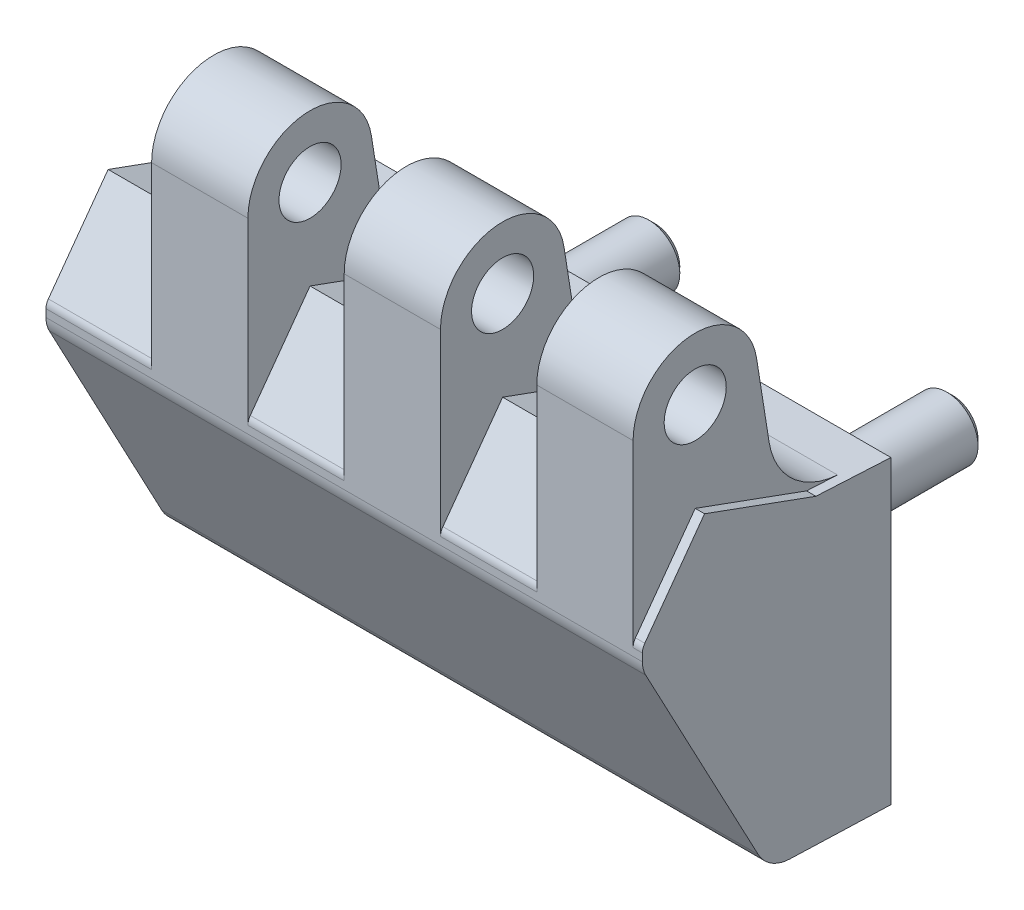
ISO-10303-21;
HEADER;
FILE_DESCRIPTION(('STEP AP214'),'2;1');
FILE_NAME('part.step','',(''),(''),'','','');
FILE_SCHEMA(('AUTOMOTIVE_DESIGN { 1 0 10303 214 1 1 1 1 }'));
ENDSEC;
DATA;
#1=APPLICATION_CONTEXT('core data for automotive mechanical design processes');
#2=APPLICATION_PROTOCOL_DEFINITION('international standard','automotive_design',2000,#1);
#3=PRODUCT_CONTEXT('',#1,'mechanical');
#4=PRODUCT('Part','Part','',(#3));
#5=PRODUCT_RELATED_PRODUCT_CATEGORY('part','',(#4));
#6=PRODUCT_DEFINITION_FORMATION('','',#4);
#7=PRODUCT_DEFINITION_CONTEXT('part definition',#1,'design');
#8=PRODUCT_DEFINITION('design','',#6,#7);
#9=PRODUCT_DEFINITION_SHAPE('','',#8);
#10=(LENGTH_UNIT() NAMED_UNIT(*) SI_UNIT(.MILLI.,.METRE.));
#11=(NAMED_UNIT(*) PLANE_ANGLE_UNIT() SI_UNIT($,.RADIAN.));
#12=(NAMED_UNIT(*) SI_UNIT($,.STERADIAN.) SOLID_ANGLE_UNIT());
#13=UNCERTAINTY_MEASURE_WITH_UNIT(LENGTH_MEASURE(1.E-05),#10,'distance_accuracy_value','');
#14=(GEOMETRIC_REPRESENTATION_CONTEXT(3) GLOBAL_UNCERTAINTY_ASSIGNED_CONTEXT((#13)) GLOBAL_UNIT_ASSIGNED_CONTEXT((#10,
#11,#12)) REPRESENTATION_CONTEXT('',''));
#15=CARTESIAN_POINT('',(0.,0.,0.));
#16=DIRECTION('',(0.,0.,1.));
#17=DIRECTION('',(1.,0.,0.));
#18=AXIS2_PLACEMENT_3D('',#15,#16,#17);
#19=CARTESIAN_POINT('',(-12.25,12.2,0.));
#20=DIRECTION('',(0.,0.99862953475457,-0.0523359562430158));
#21=DIRECTION('',(0.,0.0523359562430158,0.99862953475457));
#22=AXIS2_PLACEMENT_3D('',#19,#20,#21);
#23=PLANE('',#22);
#24=DIRECTION('',(1.,0.,0.));
#25=VECTOR('',#24,1.);
#26=CARTESIAN_POINT('',(-12.25,12.2,0.));
#27=LINE('',#26,#25);
#28=CARTESIAN_POINT('',(-12.,12.2,0.));
#29=VERTEX_POINT('',#28);
#30=CARTESIAN_POINT('',(36.,12.2,0.));
#31=VERTEX_POINT('',#30);
#32=EDGE_CURVE('E259',#29,#31,#27,.T.);
#33=ORIENTED_EDGE('',*,*,#32,.F.);
#34=DIRECTION('',(0.,-0.0523359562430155,-0.99862953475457));
#35=VECTOR('',#34,1.);
#36=CARTESIAN_POINT('',(-12.,12.516495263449,6.0390893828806));
#37=LINE('',#36,#35);
#38=CARTESIAN_POINT('',(-12.,12.516495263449,6.0390893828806));
#39=VERTEX_POINT('',#38);
#40=EDGE_CURVE('E241',#39,#29,#37,.T.);
#41=ORIENTED_EDGE('',*,*,#40,.F.);
#42=DIRECTION('',(1.,0.,0.));
#43=VECTOR('',#42,1.);
#44=CARTESIAN_POINT('',(-12.25,12.516495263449,6.0390893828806));
#45=LINE('',#44,#43);
#46=CARTESIAN_POINT('',(-3.5,12.516495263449,6.0390893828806));
#47=VERTEX_POINT('',#46);
#48=EDGE_CURVE('E263',#39,#47,#45,.T.);
#49=ORIENTED_EDGE('',*,*,#48,.T.);
#50=DIRECTION('',(0.,0.0523359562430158,0.99862953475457));
#51=VECTOR('',#50,1.);
#52=CARTESIAN_POINT('',(-3.5,12.2,0.));
#53=LINE('',#52,#51);
#54=CARTESIAN_POINT('',(-3.5,12.386207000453,3.55304122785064));
#55=VERTEX_POINT('',#54);
#56=EDGE_CURVE('E1156',#55,#47,#53,.T.);
#57=ORIENTED_EDGE('',*,*,#56,.F.);
#58=DIRECTION('',(1.,0.,0.));
#59=VECTOR('',#58,1.);
#60=CARTESIAN_POINT('',(-3.5,12.386207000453,3.55304122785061));
#61=LINE('',#60,#59);
#62=CARTESIAN_POINT('',(4.25,12.386207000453,3.55304122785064));
#63=VERTEX_POINT('',#62);
#64=EDGE_CURVE('E261',#63,#55,#61,.F.);
#65=ORIENTED_EDGE('',*,*,#64,.F.);
#66=DIRECTION('',(0.,0.0523359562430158,0.99862953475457));
#67=VECTOR('',#66,1.);
#68=CARTESIAN_POINT('',(4.25,12.2,0.));
#69=LINE('',#68,#67);
#70=CARTESIAN_POINT('',(4.25,12.516495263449,6.0390893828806));
#71=VERTEX_POINT('',#70);
#72=EDGE_CURVE('E1284',#63,#71,#69,.T.);
#73=ORIENTED_EDGE('',*,*,#72,.T.);
#74=CARTESIAN_POINT('',(12.,12.516495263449,6.0390893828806));
#75=VERTEX_POINT('',#74);
#76=EDGE_CURVE('E1225',#71,#75,#45,.T.);
#77=ORIENTED_EDGE('',*,*,#76,.T.);
#78=DIRECTION('',(0.,0.0523359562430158,0.99862953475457));
#79=VECTOR('',#78,1.);
#80=CARTESIAN_POINT('',(12.,12.2,0.));
#81=LINE('',#80,#79);
#82=CARTESIAN_POINT('',(12.,12.386207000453,3.55304122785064));
#83=VERTEX_POINT('',#82);
#84=EDGE_CURVE('E1193',#83,#75,#81,.T.);
#85=ORIENTED_EDGE('',*,*,#84,.F.);
#86=DIRECTION('',(-1.,0.,0.));
#87=VECTOR('',#86,1.);
#88=CARTESIAN_POINT('',(19.75,12.386207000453,3.55304122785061));
#89=LINE('',#88,#87);
#90=CARTESIAN_POINT('',(19.75,12.386207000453,3.55304122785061));
#91=VERTEX_POINT('',#90);
#92=EDGE_CURVE('E258',#83,#91,#89,.F.);
#93=ORIENTED_EDGE('',*,*,#92,.T.);
#94=DIRECTION('',(0.,0.0523359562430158,0.99862953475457));
#95=VECTOR('',#94,1.);
#96=CARTESIAN_POINT('',(19.75,12.2,0.));
#97=LINE('',#96,#95);
#98=CARTESIAN_POINT('',(19.75,12.516495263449,6.0390893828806));
#99=VERTEX_POINT('',#98);
#100=EDGE_CURVE('E1202',#91,#99,#97,.T.);
#101=ORIENTED_EDGE('',*,*,#100,.T.);
#102=CARTESIAN_POINT('',(27.5,12.516495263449,6.0390893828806));
#103=VERTEX_POINT('',#102);
#104=EDGE_CURVE('E1226',#99,#103,#45,.T.);
#105=ORIENTED_EDGE('',*,*,#104,.T.);
#106=DIRECTION('',(0.,0.0523359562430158,0.99862953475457));
#107=VECTOR('',#106,1.);
#108=CARTESIAN_POINT('',(27.5,12.2,0.));
#109=LINE('',#108,#107);
#110=CARTESIAN_POINT('',(27.5,12.386207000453,3.55304122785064));
#111=VERTEX_POINT('',#110);
#112=EDGE_CURVE('E1233',#111,#103,#109,.T.);
#113=ORIENTED_EDGE('',*,*,#112,.F.);
#114=DIRECTION('',(-1.,0.,0.));
#115=VECTOR('',#114,1.);
#116=CARTESIAN_POINT('',(35.25,12.386207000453,3.55304122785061));
#117=LINE('',#116,#115);
#118=CARTESIAN_POINT('',(35.25,12.386207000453,3.55304122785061));
#119=VERTEX_POINT('',#118);
#120=EDGE_CURVE('E268',#111,#119,#117,.F.);
#121=ORIENTED_EDGE('',*,*,#120,.T.);
#122=DIRECTION('',(0.,0.0523359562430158,0.99862953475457));
#123=VECTOR('',#122,1.);
#124=CARTESIAN_POINT('',(35.25,12.2,0.));
#125=LINE('',#124,#123);
#126=CARTESIAN_POINT('',(35.25,12.516495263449,6.0390893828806));
#127=VERTEX_POINT('',#126);
#128=EDGE_CURVE('E1114',#119,#127,#125,.T.);
#129=ORIENTED_EDGE('',*,*,#128,.T.);
#130=CARTESIAN_POINT('',(36.,12.516495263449,6.0390893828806));
#131=VERTEX_POINT('',#130);
#132=EDGE_CURVE('E1222',#127,#131,#45,.T.);
#133=ORIENTED_EDGE('',*,*,#132,.T.);
#134=DIRECTION('',(0.,0.0523359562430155,0.99862953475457));
#135=VECTOR('',#134,1.);
#136=CARTESIAN_POINT('',(36.,12.2,0.));
#137=LINE('',#136,#135);
#138=EDGE_CURVE('E1403',#31,#131,#137,.T.);
#139=ORIENTED_EDGE('',*,*,#138,.F.);
#140=EDGE_LOOP('',(#33,#41,#49,#57,#65,#73,#77,#85,#93,#101,#105,#113,#121,#129,#133,#139));
#141=FACE_BOUND('',#140,.T.);
#142=ADVANCED_FACE('F14',(#141),#23,.T.);
#143=CARTESIAN_POINT('',(-12.25,-11.715773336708,8.1391867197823));
#144=DIRECTION('',(0.,-0.999390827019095,0.0348994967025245));
#145=DIRECTION('',(0.,-0.0348994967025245,-0.999390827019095));
#146=AXIS2_PLACEMENT_3D('',#143,#144,#145);
#147=PLANE('',#146);
#148=DIRECTION('',(1.,0.,0.));
#149=VECTOR('',#148,1.);
#150=CARTESIAN_POINT('',(-12.25,-11.715773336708,8.1391867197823));
#151=LINE('',#150,#149);
#152=CARTESIAN_POINT('',(-12.,-11.715773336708,8.1391867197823));
#153=VERTEX_POINT('',#152);
#154=CARTESIAN_POINT('',(36.,-11.715773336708,8.1391867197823));
#155=VERTEX_POINT('',#154);
#156=EDGE_CURVE('E251',#153,#155,#151,.T.);
#157=ORIENTED_EDGE('',*,*,#156,.F.);
#158=DIRECTION('',(0.,0.034899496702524,0.999390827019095));
#159=VECTOR('',#158,1.);
#160=CARTESIAN_POINT('',(-12.,-12.,0.));
#161=LINE('',#160,#159);
#162=CARTESIAN_POINT('',(-12.,-12.,0.));
#163=VERTEX_POINT('',#162);
#164=EDGE_CURVE('E238',#163,#153,#161,.T.);
#165=ORIENTED_EDGE('',*,*,#164,.F.);
#166=DIRECTION('',(1.,0.,0.));
#167=VECTOR('',#166,1.);
#168=CARTESIAN_POINT('',(-12.25,-12.,0.));
#169=LINE('',#168,#167);
#170=CARTESIAN_POINT('',(36.,-12.,0.));
#171=VERTEX_POINT('',#170);
#172=EDGE_CURVE('E249',#163,#171,#169,.T.);
#173=ORIENTED_EDGE('',*,*,#172,.T.);
#174=DIRECTION('',(0.,-0.034899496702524,-0.999390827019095));
#175=VECTOR('',#174,1.);
#176=CARTESIAN_POINT('',(36.,-11.715773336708,8.1391867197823));
#177=LINE('',#176,#175);
#178=EDGE_CURVE('E1406',#155,#171,#177,.T.);
#179=ORIENTED_EDGE('',*,*,#178,.F.);
#180=EDGE_LOOP('',(#157,#165,#173,#179));
#181=FACE_BOUND('',#180,.T.);
#182=ADVANCED_FACE('F16',(#181),#147,.T.);
#183=CARTESIAN_POINT('',(-12.25,-12.,0.));
#184=DIRECTION('',(0.,0.,-1.));
#185=DIRECTION('',(-1.,0.,0.));
#186=AXIS2_PLACEMENT_3D('',#183,#184,#185);
#187=PLANE('',#186);
#188=CARTESIAN_POINT('',(0.,0.,0.));
#189=DIRECTION('',(0.,0.,-1.));
#190=DIRECTION('',(-1.,0.,0.));
#191=AXIS2_PLACEMENT_3D('',#188,#189,#190);
#192=CIRCLE('',#191,2.5);
#193=CARTESIAN_POINT('',(-2.5,0.,0.));
#194=VERTEX_POINT('',#193);
#195=EDGE_CURVE('E9',#194,#194,#192,.T.);
#196=ORIENTED_EDGE('',*,*,#195,.F.);
#197=EDGE_LOOP('',(#196));
#198=FACE_BOUND('',#197,.T.);
#199=CARTESIAN_POINT('',(24.,0.,0.));
#200=DIRECTION('',(0.,0.,-1.));
#201=DIRECTION('',(-1.,0.,0.));
#202=AXIS2_PLACEMENT_3D('',#199,#200,#201);
#203=CIRCLE('',#202,2.5);
#204=CARTESIAN_POINT('',(21.5,0.,0.));
#205=VERTEX_POINT('',#204);
#206=EDGE_CURVE('E22',#205,#205,#203,.T.);
#207=ORIENTED_EDGE('',*,*,#206,.F.);
#208=EDGE_LOOP('',(#207));
#209=FACE_BOUND('',#208,.T.);
#210=ORIENTED_EDGE('',*,*,#172,.F.);
#211=DIRECTION('',(0.,-1.,0.));
#212=VECTOR('',#211,1.);
#213=CARTESIAN_POINT('',(-12.,12.2,0.));
#214=LINE('',#213,#212);
#215=EDGE_CURVE('E235',#29,#163,#214,.T.);
#216=ORIENTED_EDGE('',*,*,#215,.F.);
#217=ORIENTED_EDGE('',*,*,#32,.T.);
#218=DIRECTION('',(0.,1.,0.));
#219=VECTOR('',#218,1.);
#220=CARTESIAN_POINT('',(36.,-12.,0.));
#221=LINE('',#220,#219);
#222=EDGE_CURVE('E257',#171,#31,#221,.T.);
#223=ORIENTED_EDGE('',*,*,#222,.F.);
#224=EDGE_LOOP('',(#210,#216,#217,#223));
#225=FACE_BOUND('',#224,.T.);
#226=ADVANCED_FACE('F255',(#198,#209,#225),#187,.T.);
#227=CARTESIAN_POINT('',(-12.25,8.571170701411,20.));
#228=DIRECTION('',(0.,0.,1.));
#229=DIRECTION('',(1.,0.,0.));
#230=AXIS2_PLACEMENT_3D('',#227,#228,#229);
#231=PLANE('',#230);
#232=DIRECTION('',(1.,0.,0.));
#233=VECTOR('',#232,1.);
#234=CARTESIAN_POINT('',(-12.25,8.571170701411,20.));
#235=LINE('',#234,#233);
#236=CARTESIAN_POINT('',(-12.,8.571170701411,20.));
#237=VERTEX_POINT('',#236);
#238=CARTESIAN_POINT('',(-3.5,8.571170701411,20.));
#239=VERTEX_POINT('',#238);
#240=EDGE_CURVE('E1211',#237,#239,#235,.T.);
#241=ORIENTED_EDGE('',*,*,#240,.F.);
#242=DIRECTION('',(0.,1.,0.));
#243=VECTOR('',#242,1.);
#244=CARTESIAN_POINT('',(-12.,7.95707840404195,20.));
#245=LINE('',#244,#243);
#246=CARTESIAN_POINT('',(-12.,7.95707840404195,20.));
#247=VERTEX_POINT('',#246);
#248=EDGE_CURVE('E29',#247,#237,#245,.T.);
#249=ORIENTED_EDGE('',*,*,#248,.F.);
#250=DIRECTION('',(1.,0.,0.));
#251=VECTOR('',#250,1.);
#252=CARTESIAN_POINT('',(-12.25,7.957078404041,20.));
#253=LINE('',#252,#251);
#254=CARTESIAN_POINT('',(36.,7.957078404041,20.));
#255=VERTEX_POINT('',#254);
#256=EDGE_CURVE('E1208',#247,#255,#253,.T.);
#257=ORIENTED_EDGE('',*,*,#256,.T.);
#258=DIRECTION('',(0.,-1.,0.));
#259=VECTOR('',#258,1.);
#260=CARTESIAN_POINT('',(36.,8.571170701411,20.));
#261=LINE('',#260,#259);
#262=CARTESIAN_POINT('',(36.,8.571170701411,20.));
#263=VERTEX_POINT('',#262);
#264=EDGE_CURVE('E1355',#263,#255,#261,.T.);
#265=ORIENTED_EDGE('',*,*,#264,.F.);
#266=CARTESIAN_POINT('',(35.25,8.571170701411,20.));
#267=VERTEX_POINT('',#266);
#268=EDGE_CURVE('E1210',#267,#263,#235,.T.);
#269=ORIENTED_EDGE('',*,*,#268,.F.);
#270=DIRECTION('',(0.,-1.,0.));
#271=VECTOR('',#270,1.);
#272=CARTESIAN_POINT('',(35.25,23.,20.));
#273=LINE('',#272,#271);
#274=CARTESIAN_POINT('',(35.25,23.,20.));
#275=VERTEX_POINT('',#274);
#276=EDGE_CURVE('E1090',#275,#267,#273,.T.);
#277=ORIENTED_EDGE('',*,*,#276,.F.);
#278=DIRECTION('',(-1.,0.,0.));
#279=VECTOR('',#278,1.);
#280=CARTESIAN_POINT('',(35.25,23.,20.));
#281=LINE('',#280,#279);
#282=CARTESIAN_POINT('',(27.5,23.,20.));
#283=VERTEX_POINT('',#282);
#284=EDGE_CURVE('E1370',#275,#283,#281,.T.);
#285=ORIENTED_EDGE('',*,*,#284,.T.);
#286=DIRECTION('',(0.,-1.,0.));
#287=VECTOR('',#286,1.);
#288=CARTESIAN_POINT('',(27.5,23.,20.));
#289=LINE('',#288,#287);
#290=CARTESIAN_POINT('',(27.5,8.571170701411,20.));
#291=VERTEX_POINT('',#290);
#292=EDGE_CURVE('E1103',#283,#291,#289,.T.);
#293=ORIENTED_EDGE('',*,*,#292,.T.);
#294=CARTESIAN_POINT('',(19.75,8.571170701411,20.));
#295=VERTEX_POINT('',#294);
#296=EDGE_CURVE('E1215',#295,#291,#235,.T.);
#297=ORIENTED_EDGE('',*,*,#296,.F.);
#298=DIRECTION('',(0.,-1.,0.));
#299=VECTOR('',#298,1.);
#300=CARTESIAN_POINT('',(19.75,23.,20.));
#301=LINE('',#300,#299);
#302=CARTESIAN_POINT('',(19.75,23.,20.));
#303=VERTEX_POINT('',#302);
#304=EDGE_CURVE('E1139',#303,#295,#301,.T.);
#305=ORIENTED_EDGE('',*,*,#304,.F.);
#306=DIRECTION('',(-1.,0.,0.));
#307=VECTOR('',#306,1.);
#308=CARTESIAN_POINT('',(19.75,23.,20.));
#309=LINE('',#308,#307);
#310=CARTESIAN_POINT('',(12.,23.,20.));
#311=VERTEX_POINT('',#310);
#312=EDGE_CURVE('E1176',#303,#311,#309,.T.);
#313=ORIENTED_EDGE('',*,*,#312,.T.);
#314=DIRECTION('',(0.,-1.,0.));
#315=VECTOR('',#314,1.);
#316=CARTESIAN_POINT('',(12.,23.,20.));
#317=LINE('',#316,#315);
#318=CARTESIAN_POINT('',(12.,8.571170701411,20.));
#319=VERTEX_POINT('',#318);
#320=EDGE_CURVE('E1152',#311,#319,#317,.T.);
#321=ORIENTED_EDGE('',*,*,#320,.T.);
#322=CARTESIAN_POINT('',(4.25,8.571170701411,20.));
#323=VERTEX_POINT('',#322);
#324=EDGE_CURVE('E1214',#323,#319,#235,.T.);
#325=ORIENTED_EDGE('',*,*,#324,.F.);
#326=DIRECTION('',(0.,-1.,0.));
#327=VECTOR('',#326,1.);
#328=CARTESIAN_POINT('',(4.25,23.,20.));
#329=LINE('',#328,#327);
#330=CARTESIAN_POINT('',(4.25,23.,20.));
#331=VERTEX_POINT('',#330);
#332=EDGE_CURVE('E1110',#331,#323,#329,.T.);
#333=ORIENTED_EDGE('',*,*,#332,.F.);
#334=DIRECTION('',(1.,0.,0.));
#335=VECTOR('',#334,1.);
#336=CARTESIAN_POINT('',(-3.5,23.,20.));
#337=LINE('',#336,#335);
#338=CARTESIAN_POINT('',(-3.5,23.,20.));
#339=VERTEX_POINT('',#338);
#340=EDGE_CURVE('E1268',#339,#331,#337,.T.);
#341=ORIENTED_EDGE('',*,*,#340,.F.);
#342=DIRECTION('',(0.,-1.,0.));
#343=VECTOR('',#342,1.);
#344=CARTESIAN_POINT('',(-3.5,23.,20.));
#345=LINE('',#344,#343);
#346=EDGE_CURVE('E1133',#339,#239,#345,.T.);
#347=ORIENTED_EDGE('',*,*,#346,.T.);
#348=EDGE_LOOP('',(#241,#249,#257,#265,#269,#277,#285,#293,#297,#305,#313,#321,#325,#333,#341,#347));
#349=FACE_BOUND('',#348,.T.);
#350=ADVANCED_FACE('F275',(#349),#231,.T.);
#351=CARTESIAN_POINT('',(-12.25,7.95707840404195,17.7499999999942));
#352=DIRECTION('',(1.,0.,0.));
#353=DIRECTION('',(0.,1.,0.));
#354=AXIS2_PLACEMENT_3D('',#351,#352,#353);
#355=CYLINDRICAL_SURFACE('',#354,2.25000000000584);
#356=ORIENTED_EDGE('',*,*,#256,.F.);
#357=CARTESIAN_POINT('',(-12.,7.95707840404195,17.7499999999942));
#358=DIRECTION('',(-1.,0.,0.));
#359=DIRECTION('',(0.,0.,1.));
#360=AXIS2_PLACEMENT_3D('',#357,#358,#359);
#361=CIRCLE('',#360,2.25000000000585);
#362=CARTESIAN_POINT('',(-12.,6.900767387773,19.736632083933));
#363=VERTEX_POINT('',#362);
#364=EDGE_CURVE('E1417',#363,#247,#361,.T.);
#365=ORIENTED_EDGE('',*,*,#364,.F.);
#366=DIRECTION('',(1.,0.,0.));
#367=VECTOR('',#366,1.);
#368=CARTESIAN_POINT('',(-12.25,6.900767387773,19.736632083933));
#369=LINE('',#368,#367);
#370=CARTESIAN_POINT('',(36.,6.900767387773,19.736632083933));
#371=VERTEX_POINT('',#370);
#372=EDGE_CURVE('E1206',#363,#371,#369,.T.);
#373=ORIENTED_EDGE('',*,*,#372,.T.);
#374=CARTESIAN_POINT('',(36.,7.95707840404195,17.7499999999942));
#375=DIRECTION('',(1.,0.,0.));
#376=DIRECTION('',(0.,0.,-1.));
#377=AXIS2_PLACEMENT_3D('',#374,#375,#376);
#378=CIRCLE('',#377,2.25000000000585);
#379=EDGE_CURVE('E1395',#255,#371,#378,.T.);
#380=ORIENTED_EDGE('',*,*,#379,.F.);
#381=EDGE_LOOP('',(#356,#365,#373,#380));
#382=FACE_BOUND('',#381,.T.);
#383=ADVANCED_FACE('F283',(#382),#355,.T.);
#384=CARTESIAN_POINT('',(-12.25,6.900767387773,19.736632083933));
#385=DIRECTION('',(0.,-0.469471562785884,0.882947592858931));
#386=DIRECTION('',(0.,-0.882947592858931,-0.469471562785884));
#387=AXIS2_PLACEMENT_3D('',#384,#385,#386);
#388=PLANE('',#387);
#389=ORIENTED_EDGE('',*,*,#372,.F.);
#390=DIRECTION('',(0.,0.882947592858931,0.469471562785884));
#391=VECTOR('',#390,1.);
#392=CARTESIAN_POINT('',(-12.,-10.126015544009,10.683331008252));
#393=LINE('',#392,#391);
#394=CARTESIAN_POINT('',(-12.,-10.126015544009,10.683331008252));
#395=VERTEX_POINT('',#394);
#396=EDGE_CURVE('E1419',#395,#363,#393,.T.);
#397=ORIENTED_EDGE('',*,*,#396,.F.);
#398=DIRECTION('',(1.,0.,0.));
#399=VECTOR('',#398,1.);
#400=CARTESIAN_POINT('',(-12.25,-10.126015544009,10.683331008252));
#401=LINE('',#400,#399);
#402=CARTESIAN_POINT('',(36.,-10.126015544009,10.683331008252));
#403=VERTEX_POINT('',#402);
#404=EDGE_CURVE('E37',#395,#403,#401,.T.);
#405=ORIENTED_EDGE('',*,*,#404,.T.);
#406=DIRECTION('',(0.,-0.882947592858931,-0.469471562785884));
#407=VECTOR('',#406,1.);
#408=CARTESIAN_POINT('',(36.,6.900767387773,19.736632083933));
#409=LINE('',#408,#407);
#410=EDGE_CURVE('E1393',#371,#403,#409,.T.);
#411=ORIENTED_EDGE('',*,*,#410,.F.);
#412=EDGE_LOOP('',(#389,#397,#405,#411));
#413=FACE_BOUND('',#412,.T.);
#414=ADVANCED_FACE('F315',(#413),#388,.T.);
#415=CARTESIAN_POINT('',(-12.25,-8.7176008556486,8.03448822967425));
#416=DIRECTION('',(1.,0.,0.));
#417=DIRECTION('',(0.,1.,0.));
#418=AXIS2_PLACEMENT_3D('',#415,#416,#417);
#419=CYLINDRICAL_SURFACE('',#418,3.00000000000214);
#420=ORIENTED_EDGE('',*,*,#404,.F.);
#421=CARTESIAN_POINT('',(-12.,-8.7176008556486,8.03448822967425));
#422=DIRECTION('',(-1.,0.,0.));
#423=DIRECTION('',(0.,0.,1.));
#424=AXIS2_PLACEMENT_3D('',#421,#422,#423);
#425=CIRCLE('',#424,3.00000000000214);
#426=EDGE_CURVE('E252',#153,#395,#425,.T.);
#427=ORIENTED_EDGE('',*,*,#426,.F.);
#428=ORIENTED_EDGE('',*,*,#156,.T.);
#429=CARTESIAN_POINT('',(36.,-8.7176008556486,8.03448822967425));
#430=DIRECTION('',(1.,0.,0.));
#431=DIRECTION('',(0.,0.,-1.));
#432=AXIS2_PLACEMENT_3D('',#429,#430,#431);
#433=CIRCLE('',#432,3.00000000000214);
#434=EDGE_CURVE('E1408',#403,#155,#433,.T.);
#435=ORIENTED_EDGE('',*,*,#434,.F.);
#436=EDGE_LOOP('',(#420,#427,#428,#435));
#437=FACE_BOUND('',#436,.T.);
#438=ADVANCED_FACE('F298',(#437),#419,.T.);
#439=CARTESIAN_POINT('',(-12.25,12.516495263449,6.0390893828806));
#440=DIRECTION('',(0.,0.939692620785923,-0.342020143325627));
#441=DIRECTION('',(0.,0.342020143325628,0.939692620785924));
#442=AXIS2_PLACEMENT_3D('',#439,#440,#441);
#443=PLANE('',#442);
#444=ORIENTED_EDGE('',*,*,#48,.F.);
#445=DIRECTION('',(0.,-0.342020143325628,-0.939692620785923));
#446=VECTOR('',#445,1.);
#447=CARTESIAN_POINT('',(-12.,15.778,15.));
#448=LINE('',#447,#446);
#449=CARTESIAN_POINT('',(-12.,15.778,15.));
#450=VERTEX_POINT('',#449);
#451=EDGE_CURVE('E1412',#450,#39,#448,.T.);
#452=ORIENTED_EDGE('',*,*,#451,.F.);
#453=DIRECTION('',(1.,0.,0.));
#454=VECTOR('',#453,1.);
#455=CARTESIAN_POINT('',(-12.25,15.778,15.));
#456=LINE('',#455,#454);
#457=CARTESIAN_POINT('',(-3.5,15.778,15.));
#458=VERTEX_POINT('',#457);
#459=EDGE_CURVE('E1221',#450,#458,#456,.T.);
#460=ORIENTED_EDGE('',*,*,#459,.T.);
#461=DIRECTION('',(0.,0.342020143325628,0.939692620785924));
#462=VECTOR('',#461,1.);
#463=CARTESIAN_POINT('',(-3.5,12.516495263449,6.0390893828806));
#464=LINE('',#463,#462);
#465=EDGE_CURVE('E1162',#47,#458,#464,.T.);
#466=ORIENTED_EDGE('',*,*,#465,.F.);
#467=EDGE_LOOP('',(#444,#452,#460,#466));
#468=FACE_BOUND('',#467,.T.);
#469=ADVANCED_FACE('F294',(#468),#443,.T.);
#470=CARTESIAN_POINT('',(-12.25,15.778,15.));
#471=DIRECTION('',(0.,0.587785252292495,0.809016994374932));
#472=DIRECTION('',(0.,-0.809016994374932,0.587785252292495));
#473=AXIS2_PLACEMENT_3D('',#470,#471,#472);
#474=PLANE('',#473);
#475=ORIENTED_EDGE('',*,*,#459,.F.);
#476=DIRECTION('',(0.,0.809016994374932,-0.587785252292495));
#477=VECTOR('',#476,1.);
#478=CARTESIAN_POINT('',(-12.,9.158955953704,19.809016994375));
#479=LINE('',#478,#477);
#480=CARTESIAN_POINT('',(-12.,9.158955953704,19.809016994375));
#481=VERTEX_POINT('',#480);
#482=EDGE_CURVE('E1302',#481,#450,#479,.T.);
#483=ORIENTED_EDGE('',*,*,#482,.F.);
#484=DIRECTION('',(1.,0.,0.));
#485=VECTOR('',#484,1.);
#486=CARTESIAN_POINT('',(-12.25,9.158955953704,19.809016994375));
#487=LINE('',#486,#485);
#488=CARTESIAN_POINT('',(-3.5,9.158955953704,19.809016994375));
#489=VERTEX_POINT('',#488);
#490=EDGE_CURVE('E1216',#481,#489,#487,.T.);
#491=ORIENTED_EDGE('',*,*,#490,.T.);
#492=DIRECTION('',(0.,-0.809016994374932,0.587785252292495));
#493=VECTOR('',#492,1.);
#494=CARTESIAN_POINT('',(-3.5,15.778,15.));
#495=LINE('',#494,#493);
#496=EDGE_CURVE('E1290',#458,#489,#495,.T.);
#497=ORIENTED_EDGE('',*,*,#496,.F.);
#498=EDGE_LOOP('',(#475,#483,#491,#497));
#499=FACE_BOUND('',#498,.T.);
#500=ADVANCED_FACE('F297',(#499),#474,.T.);
#501=CARTESIAN_POINT('',(-12.25,8.5711707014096,18.9999999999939));
#502=DIRECTION('',(1.,0.,0.));
#503=DIRECTION('',(0.,1.,0.));
#504=AXIS2_PLACEMENT_3D('',#501,#502,#503);
#505=CYLINDRICAL_SURFACE('',#504,1.00000000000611);
#506=ORIENTED_EDGE('',*,*,#490,.F.);
#507=CARTESIAN_POINT('',(-12.,8.5711707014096,18.9999999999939));
#508=DIRECTION('',(-1.,0.,0.));
#509=DIRECTION('',(0.,0.,1.));
#510=AXIS2_PLACEMENT_3D('',#507,#508,#509);
#511=CIRCLE('',#510,1.0000000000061);
#512=EDGE_CURVE('E1303',#237,#481,#511,.T.);
#513=ORIENTED_EDGE('',*,*,#512,.F.);
#514=ORIENTED_EDGE('',*,*,#240,.T.);
#515=CARTESIAN_POINT('',(-3.5,8.5711707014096,18.9999999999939));
#516=DIRECTION('',(-1.,0.,0.));
#517=DIRECTION('',(0.,-1.,0.));
#518=AXIS2_PLACEMENT_3D('',#515,#516,#517);
#519=CIRCLE('',#518,1.00000000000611);
#520=EDGE_CURVE('E1287',#489,#239,#519,.F.);
#521=ORIENTED_EDGE('',*,*,#520,.F.);
#522=EDGE_LOOP('',(#506,#513,#514,#521));
#523=FACE_BOUND('',#522,.T.);
#524=ADVANCED_FACE('F304',(#523),#505,.T.);
#525=CARTESIAN_POINT('',(35.25,15.778,15.));
#526=VERTEX_POINT('',#525);
#527=CARTESIAN_POINT('',(36.,15.778,15.));
#528=VERTEX_POINT('',#527);
#529=EDGE_CURVE('E1218',#526,#528,#456,.T.);
#530=ORIENTED_EDGE('',*,*,#529,.T.);
#531=DIRECTION('',(0.,0.342020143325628,0.939692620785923));
#532=VECTOR('',#531,1.);
#533=CARTESIAN_POINT('',(36.,12.516495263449,6.0390893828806));
#534=LINE('',#533,#532);
#535=EDGE_CURVE('E1337',#131,#528,#534,.T.);
#536=ORIENTED_EDGE('',*,*,#535,.F.);
#537=ORIENTED_EDGE('',*,*,#132,.F.);
#538=DIRECTION('',(0.,0.342020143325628,0.939692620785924));
#539=VECTOR('',#538,1.);
#540=CARTESIAN_POINT('',(35.25,12.516495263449,6.0390893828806));
#541=LINE('',#540,#539);
#542=EDGE_CURVE('E1252',#127,#526,#541,.T.);
#543=ORIENTED_EDGE('',*,*,#542,.T.);
#544=EDGE_LOOP('',(#530,#536,#537,#543));
#545=FACE_BOUND('',#544,.T.);
#546=ADVANCED_FACE('F300',(#545),#443,.T.);
#547=CARTESIAN_POINT('',(35.25,9.158955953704,19.809016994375));
#548=VERTEX_POINT('',#547);
#549=CARTESIAN_POINT('',(36.,9.158955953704,19.809016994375));
#550=VERTEX_POINT('',#549);
#551=EDGE_CURVE('E1213',#548,#550,#487,.T.);
#552=ORIENTED_EDGE('',*,*,#551,.T.);
#553=DIRECTION('',(0.,-0.809016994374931,0.587785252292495));
#554=VECTOR('',#553,1.);
#555=CARTESIAN_POINT('',(36.,15.778,15.));
#556=LINE('',#555,#554);
#557=EDGE_CURVE('E1343',#528,#550,#556,.T.);
#558=ORIENTED_EDGE('',*,*,#557,.F.);
#559=ORIENTED_EDGE('',*,*,#529,.F.);
#560=DIRECTION('',(0.,-0.809016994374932,0.587785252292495));
#561=VECTOR('',#560,1.);
#562=CARTESIAN_POINT('',(35.25,15.778,15.));
#563=LINE('',#562,#561);
#564=EDGE_CURVE('E1245',#526,#548,#563,.T.);
#565=ORIENTED_EDGE('',*,*,#564,.T.);
#566=EDGE_LOOP('',(#552,#558,#559,#565));
#567=FACE_BOUND('',#566,.T.);
#568=ADVANCED_FACE('F306',(#567),#474,.T.);
#569=ORIENTED_EDGE('',*,*,#268,.T.);
#570=CARTESIAN_POINT('',(36.,8.5711707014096,18.9999999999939));
#571=DIRECTION('',(1.,0.,0.));
#572=DIRECTION('',(0.,0.,-1.));
#573=AXIS2_PLACEMENT_3D('',#570,#571,#572);
#574=CIRCLE('',#573,1.00000000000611);
#575=EDGE_CURVE('E1399',#550,#263,#574,.T.);
#576=ORIENTED_EDGE('',*,*,#575,.F.);
#577=ORIENTED_EDGE('',*,*,#551,.F.);
#578=CARTESIAN_POINT('',(35.25,8.5711707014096,18.9999999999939));
#579=DIRECTION('',(-1.,0.,0.));
#580=DIRECTION('',(0.,-1.,0.));
#581=AXIS2_PLACEMENT_3D('',#578,#579,#580);
#582=CIRCLE('',#581,1.00000000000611);
#583=EDGE_CURVE('E1243',#548,#267,#582,.F.);
#584=ORIENTED_EDGE('',*,*,#583,.T.);
#585=EDGE_LOOP('',(#569,#576,#577,#584));
#586=FACE_BOUND('',#585,.T.);
#587=ADVANCED_FACE('F310',(#586),#505,.T.);
#588=ORIENTED_EDGE('',*,*,#76,.F.);
#589=DIRECTION('',(0.,0.342020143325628,0.939692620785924));
#590=VECTOR('',#589,1.);
#591=CARTESIAN_POINT('',(4.25,12.516495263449,6.0390893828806));
#592=LINE('',#591,#590);
#593=CARTESIAN_POINT('',(4.25,15.778,15.));
#594=VERTEX_POINT('',#593);
#595=EDGE_CURVE('E1281',#71,#594,#592,.T.);
#596=ORIENTED_EDGE('',*,*,#595,.T.);
#597=CARTESIAN_POINT('',(12.,15.778,15.));
#598=VERTEX_POINT('',#597);
#599=EDGE_CURVE('E1223',#594,#598,#456,.T.);
#600=ORIENTED_EDGE('',*,*,#599,.T.);
#601=DIRECTION('',(0.,0.342020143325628,0.939692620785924));
#602=VECTOR('',#601,1.);
#603=CARTESIAN_POINT('',(12.,12.516495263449,6.0390893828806));
#604=LINE('',#603,#602);
#605=EDGE_CURVE('E1190',#75,#598,#604,.T.);
#606=ORIENTED_EDGE('',*,*,#605,.F.);
#607=EDGE_LOOP('',(#588,#596,#600,#606));
#608=FACE_BOUND('',#607,.T.);
#609=ADVANCED_FACE('F577',(#608),#443,.T.);
#610=ORIENTED_EDGE('',*,*,#599,.F.);
#611=DIRECTION('',(0.,-0.809016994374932,0.587785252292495));
#612=VECTOR('',#611,1.);
#613=CARTESIAN_POINT('',(4.25,15.778,15.));
#614=LINE('',#613,#612);
#615=CARTESIAN_POINT('',(4.25,9.158955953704,19.809016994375));
#616=VERTEX_POINT('',#615);
#617=EDGE_CURVE('E1278',#594,#616,#614,.T.);
#618=ORIENTED_EDGE('',*,*,#617,.T.);
#619=CARTESIAN_POINT('',(12.,9.158955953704,19.809016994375));
#620=VERTEX_POINT('',#619);
#621=EDGE_CURVE('E1219',#616,#620,#487,.T.);
#622=ORIENTED_EDGE('',*,*,#621,.T.);
#623=DIRECTION('',(0.,-0.809016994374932,0.587785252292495));
#624=VECTOR('',#623,1.);
#625=CARTESIAN_POINT('',(12.,15.778,15.));
#626=LINE('',#625,#624);
#627=EDGE_CURVE('E1187',#598,#620,#626,.T.);
#628=ORIENTED_EDGE('',*,*,#627,.F.);
#629=EDGE_LOOP('',(#610,#618,#622,#628));
#630=FACE_BOUND('',#629,.T.);
#631=ADVANCED_FACE('F569',(#630),#474,.T.);
#632=ORIENTED_EDGE('',*,*,#621,.F.);
#633=CARTESIAN_POINT('',(4.25,8.5711707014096,18.9999999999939));
#634=DIRECTION('',(-1.,0.,0.));
#635=DIRECTION('',(0.,-1.,0.));
#636=AXIS2_PLACEMENT_3D('',#633,#634,#635);
#637=CIRCLE('',#636,1.00000000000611);
#638=EDGE_CURVE('E1275',#616,#323,#637,.F.);
#639=ORIENTED_EDGE('',*,*,#638,.T.);
#640=ORIENTED_EDGE('',*,*,#324,.T.);
#641=CARTESIAN_POINT('',(12.,8.5711707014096,18.9999999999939));
#642=DIRECTION('',(-1.,0.,0.));
#643=DIRECTION('',(0.,-1.,0.));
#644=AXIS2_PLACEMENT_3D('',#641,#642,#643);
#645=CIRCLE('',#644,1.00000000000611);
#646=EDGE_CURVE('E1184',#620,#319,#645,.F.);
#647=ORIENTED_EDGE('',*,*,#646,.F.);
#648=EDGE_LOOP('',(#632,#639,#640,#647));
#649=FACE_BOUND('',#648,.T.);
#650=ADVANCED_FACE('F561',(#649),#505,.T.);
#651=DIRECTION('',(0.,0.342020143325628,0.939692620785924));
#652=VECTOR('',#651,1.);
#653=CARTESIAN_POINT('',(27.5,12.516495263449,6.0390893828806));
#654=LINE('',#653,#652);
#655=CARTESIAN_POINT('',(27.5,15.778,15.));
#656=VERTEX_POINT('',#655);
#657=EDGE_CURVE('E1241',#103,#656,#654,.T.);
#658=ORIENTED_EDGE('',*,*,#657,.F.);
#659=ORIENTED_EDGE('',*,*,#104,.F.);
#660=DIRECTION('',(0.,0.342020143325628,0.939692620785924));
#661=VECTOR('',#660,1.);
#662=CARTESIAN_POINT('',(19.75,12.516495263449,6.0390893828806));
#663=LINE('',#662,#661);
#664=CARTESIAN_POINT('',(19.75,15.778,15.));
#665=VERTEX_POINT('',#664);
#666=EDGE_CURVE('E1200',#99,#665,#663,.T.);
#667=ORIENTED_EDGE('',*,*,#666,.T.);
#668=EDGE_CURVE('E1224',#665,#656,#456,.T.);
#669=ORIENTED_EDGE('',*,*,#668,.T.);
#670=EDGE_LOOP('',(#658,#659,#667,#669));
#671=FACE_BOUND('',#670,.T.);
#672=ADVANCED_FACE('F301',(#671),#443,.T.);
#673=DIRECTION('',(0.,-0.809016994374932,0.587785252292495));
#674=VECTOR('',#673,1.);
#675=CARTESIAN_POINT('',(27.5,15.778,15.));
#676=LINE('',#675,#674);
#677=CARTESIAN_POINT('',(27.5,9.158955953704,19.809016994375));
#678=VERTEX_POINT('',#677);
#679=EDGE_CURVE('E1247',#656,#678,#676,.T.);
#680=ORIENTED_EDGE('',*,*,#679,.F.);
#681=ORIENTED_EDGE('',*,*,#668,.F.);
#682=DIRECTION('',(0.,-0.809016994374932,0.587785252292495));
#683=VECTOR('',#682,1.);
#684=CARTESIAN_POINT('',(19.75,15.778,15.));
#685=LINE('',#684,#683);
#686=CARTESIAN_POINT('',(19.75,9.158955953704,19.809016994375));
#687=VERTEX_POINT('',#686);
#688=EDGE_CURVE('E1198',#665,#687,#685,.T.);
#689=ORIENTED_EDGE('',*,*,#688,.T.);
#690=EDGE_CURVE('E1220',#687,#678,#487,.T.);
#691=ORIENTED_EDGE('',*,*,#690,.T.);
#692=EDGE_LOOP('',(#680,#681,#689,#691));
#693=FACE_BOUND('',#692,.T.);
#694=ADVANCED_FACE('F307',(#693),#474,.T.);
#695=CARTESIAN_POINT('',(27.5,8.5711707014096,18.9999999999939));
#696=DIRECTION('',(-1.,0.,0.));
#697=DIRECTION('',(0.,-1.,0.));
#698=AXIS2_PLACEMENT_3D('',#695,#696,#697);
#699=CIRCLE('',#698,1.00000000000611);
#700=EDGE_CURVE('E1361',#678,#291,#699,.F.);
#701=ORIENTED_EDGE('',*,*,#700,.F.);
#702=ORIENTED_EDGE('',*,*,#690,.F.);
#703=CARTESIAN_POINT('',(19.75,8.5711707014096,18.9999999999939));
#704=DIRECTION('',(-1.,0.,0.));
#705=DIRECTION('',(0.,-1.,0.));
#706=AXIS2_PLACEMENT_3D('',#703,#704,#705);
#707=CIRCLE('',#706,1.00000000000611);
#708=EDGE_CURVE('E1196',#687,#295,#707,.F.);
#709=ORIENTED_EDGE('',*,*,#708,.T.);
#710=ORIENTED_EDGE('',*,*,#296,.T.);
#711=EDGE_LOOP('',(#701,#702,#709,#710));
#712=FACE_BOUND('',#711,.T.);
#713=ADVANCED_FACE('F311',(#712),#505,.T.);
#714=CARTESIAN_POINT('',(19.75,18.3712579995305,3.12976290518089));
#715=DIRECTION('',(-1.,0.,0.));
#716=DIRECTION('',(0.,-1.,0.));
#717=AXIS2_PLACEMENT_3D('',#714,#715,#716);
#718=CYLINDRICAL_SURFACE('',#717,6.00000000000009);
#719=ORIENTED_EDGE('',*,*,#92,.F.);
#720=CARTESIAN_POINT('',(12.,18.3712579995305,3.12976290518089));
#721=DIRECTION('',(-1.,0.,0.));
#722=DIRECTION('',(0.,1.,0.));
#723=AXIS2_PLACEMENT_3D('',#720,#721,#722);
#724=CIRCLE('',#723,6.00000000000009);
#725=CARTESIAN_POINT('',(12.,17.4326512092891,9.0558929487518));
#726=VERTEX_POINT('',#725);
#727=EDGE_CURVE('E1148',#83,#726,#724,.T.);
#728=ORIENTED_EDGE('',*,*,#727,.T.);
#729=DIRECTION('',(-1.,0.,0.));
#730=VECTOR('',#729,1.);
#731=CARTESIAN_POINT('',(19.75,17.4326512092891,9.0558929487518));
#732=LINE('',#731,#730);
#733=CARTESIAN_POINT('',(19.75,17.4326512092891,9.0558929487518));
#734=VERTEX_POINT('',#733);
#735=EDGE_CURVE('E1181',#734,#726,#732,.T.);
#736=ORIENTED_EDGE('',*,*,#735,.F.);
#737=CARTESIAN_POINT('',(19.75,18.3712579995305,3.12976290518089));
#738=DIRECTION('',(-1.,0.,0.));
#739=DIRECTION('',(0.,1.,0.));
#740=AXIS2_PLACEMENT_3D('',#737,#738,#739);
#741=CIRCLE('',#740,6.00000000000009);
#742=EDGE_CURVE('E1165',#91,#734,#741,.T.);
#743=ORIENTED_EDGE('',*,*,#742,.F.);
#744=EDGE_LOOP('',(#719,#728,#736,#743));
#745=FACE_BOUND('',#744,.T.);
#746=ADVANCED_FACE('F322',(#745),#718,.F.);
#747=CARTESIAN_POINT('',(19.75,17.4326512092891,9.0558929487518));
#748=DIRECTION('',(0.,-0.156434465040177,0.987688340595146));
#749=DIRECTION('',(0.,-0.987688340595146,-0.156434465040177));
#750=AXIS2_PLACEMENT_3D('',#747,#748,#749);
#751=PLANE('',#750);
#752=DIRECTION('',(0.,0.987688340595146,0.156434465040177));
#753=VECTOR('',#752,1.);
#754=CARTESIAN_POINT('',(12.,17.4326512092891,9.0558929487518));
#755=LINE('',#754,#753);
#756=CARTESIAN_POINT('',(12.,23.7821723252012,10.061558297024));
#757=VERTEX_POINT('',#756);
#758=EDGE_CURVE('E1144',#726,#757,#755,.T.);
#759=ORIENTED_EDGE('',*,*,#758,.T.);
#760=DIRECTION('',(-1.,0.,0.));
#761=VECTOR('',#760,1.);
#762=CARTESIAN_POINT('',(19.75,23.7821723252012,10.061558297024));
#763=LINE('',#762,#761);
#764=CARTESIAN_POINT('',(19.75,23.7821723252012,10.061558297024));
#765=VERTEX_POINT('',#764);
#766=EDGE_CURVE('E1178',#765,#757,#763,.T.);
#767=ORIENTED_EDGE('',*,*,#766,.F.);
#768=DIRECTION('',(0.,0.987688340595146,0.156434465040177));
#769=VECTOR('',#768,1.);
#770=CARTESIAN_POINT('',(19.75,17.4326512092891,9.0558929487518));
#771=LINE('',#770,#769);
#772=EDGE_CURVE('E1167',#734,#765,#771,.T.);
#773=ORIENTED_EDGE('',*,*,#772,.F.);
#774=ORIENTED_EDGE('',*,*,#735,.T.);
#775=EDGE_LOOP('',(#759,#767,#773,#774));
#776=FACE_BOUND('',#775,.T.);
#777=ADVANCED_FACE('F325',(#776),#751,.F.);
#778=CARTESIAN_POINT('',(19.75,23.,14.9999999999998));
#779=DIRECTION('',(-1.,0.,0.));
#780=DIRECTION('',(0.,-1.,0.));
#781=AXIS2_PLACEMENT_3D('',#778,#779,#780);
#782=CYLINDRICAL_SURFACE('',#781,5.00000000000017);
#783=CARTESIAN_POINT('',(12.,23.,14.9999999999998));
#784=DIRECTION('',(1.,0.,0.));
#785=DIRECTION('',(0.,-1.,0.));
#786=AXIS2_PLACEMENT_3D('',#783,#784,#785);
#787=CIRCLE('',#786,5.00000000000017);
#788=EDGE_CURVE('E1140',#757,#311,#787,.T.);
#789=ORIENTED_EDGE('',*,*,#788,.T.);
#790=ORIENTED_EDGE('',*,*,#312,.F.);
#791=CARTESIAN_POINT('',(19.75,23.,14.9999999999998));
#792=DIRECTION('',(1.,0.,0.));
#793=DIRECTION('',(0.,-1.,0.));
#794=AXIS2_PLACEMENT_3D('',#791,#792,#793);
#795=CIRCLE('',#794,5.00000000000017);
#796=EDGE_CURVE('E1169',#765,#303,#795,.T.);
#797=ORIENTED_EDGE('',*,*,#796,.F.);
#798=ORIENTED_EDGE('',*,*,#766,.T.);
#799=EDGE_LOOP('',(#789,#790,#797,#798));
#800=FACE_BOUND('',#799,.T.);
#801=ADVANCED_FACE('F329',(#800),#782,.T.);
#802=CARTESIAN_POINT('',(19.75,23.,15.));
#803=DIRECTION('',(-1.,0.,0.));
#804=DIRECTION('',(0.,-1.,0.));
#805=AXIS2_PLACEMENT_3D('',#802,#803,#804);
#806=CYLINDRICAL_SURFACE('',#805,2.5);
#807=CARTESIAN_POINT('',(19.75,23.,15.));
#808=DIRECTION('',(1.,0.,0.));
#809=DIRECTION('',(0.,1.,0.));
#810=AXIS2_PLACEMENT_3D('',#807,#808,#809);
#811=CIRCLE('',#810,2.5);
#812=CARTESIAN_POINT('',(19.75,25.5,15.));
#813=VERTEX_POINT('',#812);
#814=EDGE_CURVE('E1171',#813,#813,#811,.T.);
#815=ORIENTED_EDGE('',*,*,#814,.T.);
#816=EDGE_LOOP('',(#815));
#817=FACE_BOUND('',#816,.T.);
#818=CARTESIAN_POINT('',(12.,23.,15.));
#819=DIRECTION('',(1.,0.,0.));
#820=DIRECTION('',(0.,1.,0.));
#821=AXIS2_PLACEMENT_3D('',#818,#819,#820);
#822=CIRCLE('',#821,2.5);
#823=CARTESIAN_POINT('',(12.,25.5,15.));
#824=VERTEX_POINT('',#823);
#825=EDGE_CURVE('E1135',#824,#824,#822,.T.);
#826=ORIENTED_EDGE('',*,*,#825,.F.);
#827=EDGE_LOOP('',(#826));
#828=FACE_BOUND('',#827,.T.);
#829=ADVANCED_FACE('F333',(#817,#828),#806,.F.);
#830=CARTESIAN_POINT('',(19.75,18.3712579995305,3.12976290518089));
#831=DIRECTION('',(-1.,0.,0.));
#832=DIRECTION('',(0.,-1.,0.));
#833=AXIS2_PLACEMENT_3D('',#830,#831,#832);
#834=PLANE('',#833);
#835=ORIENTED_EDGE('',*,*,#100,.F.);
#836=ORIENTED_EDGE('',*,*,#742,.T.);
#837=ORIENTED_EDGE('',*,*,#772,.T.);
#838=ORIENTED_EDGE('',*,*,#796,.T.);
#839=ORIENTED_EDGE('',*,*,#304,.T.);
#840=ORIENTED_EDGE('',*,*,#708,.F.);
#841=ORIENTED_EDGE('',*,*,#688,.F.);
#842=ORIENTED_EDGE('',*,*,#666,.F.);
#843=EDGE_LOOP('',(#835,#836,#837,#838,#839,#840,#841,#842));
#844=FACE_BOUND('',#843,.T.);
#845=ORIENTED_EDGE('',*,*,#814,.F.);
#846=EDGE_LOOP('',(#845));
#847=FACE_BOUND('',#846,.T.);
#848=ADVANCED_FACE('F337',(#844,#847),#834,.F.);
#849=CARTESIAN_POINT('',(12.,18.3712579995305,3.12976290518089));
#850=DIRECTION('',(-1.,0.,0.));
#851=DIRECTION('',(0.,-1.,0.));
#852=AXIS2_PLACEMENT_3D('',#849,#850,#851);
#853=PLANE('',#852);
#854=ORIENTED_EDGE('',*,*,#727,.F.);
#855=ORIENTED_EDGE('',*,*,#84,.T.);
#856=ORIENTED_EDGE('',*,*,#605,.T.);
#857=ORIENTED_EDGE('',*,*,#627,.T.);
#858=ORIENTED_EDGE('',*,*,#646,.T.);
#859=ORIENTED_EDGE('',*,*,#320,.F.);
#860=ORIENTED_EDGE('',*,*,#788,.F.);
#861=ORIENTED_EDGE('',*,*,#758,.F.);
#862=EDGE_LOOP('',(#854,#855,#856,#857,#858,#859,#860,#861));
#863=FACE_BOUND('',#862,.T.);
#864=ORIENTED_EDGE('',*,*,#825,.T.);
#865=EDGE_LOOP('',(#864));
#866=FACE_BOUND('',#865,.T.);
#867=ADVANCED_FACE('F341',(#863,#866),#853,.T.);
#868=CARTESIAN_POINT('',(-3.5,18.3712579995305,3.12976290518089));
#869=DIRECTION('',(1.,0.,0.));
#870=DIRECTION('',(0.,1.,0.));
#871=AXIS2_PLACEMENT_3D('',#868,#869,#870);
#872=CYLINDRICAL_SURFACE('',#871,6.00000000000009);
#873=CARTESIAN_POINT('',(4.25,18.3712579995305,3.12976290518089));
#874=DIRECTION('',(-1.,0.,0.));
#875=DIRECTION('',(0.,1.,0.));
#876=AXIS2_PLACEMENT_3D('',#873,#874,#875);
#877=CIRCLE('',#876,6.00000000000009);
#878=CARTESIAN_POINT('',(4.25,17.4326512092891,9.0558929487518));
#879=VERTEX_POINT('',#878);
#880=EDGE_CURVE('E1113',#63,#879,#877,.T.);
#881=ORIENTED_EDGE('',*,*,#880,.F.);
#882=ORIENTED_EDGE('',*,*,#64,.T.);
#883=CARTESIAN_POINT('',(-3.5,18.3712579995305,3.12976290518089));
#884=DIRECTION('',(-1.,0.,0.));
#885=DIRECTION('',(0.,1.,0.));
#886=AXIS2_PLACEMENT_3D('',#883,#884,#885);
#887=CIRCLE('',#886,6.00000000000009);
#888=CARTESIAN_POINT('',(-3.5,17.4326512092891,9.0558929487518));
#889=VERTEX_POINT('',#888);
#890=EDGE_CURVE('E1255',#55,#889,#887,.T.);
#891=ORIENTED_EDGE('',*,*,#890,.T.);
#892=DIRECTION('',(1.,0.,0.));
#893=VECTOR('',#892,1.);
#894=CARTESIAN_POINT('',(-3.5,17.4326512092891,9.0558929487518));
#895=LINE('',#894,#893);
#896=EDGE_CURVE('E1272',#889,#879,#895,.T.);
#897=ORIENTED_EDGE('',*,*,#896,.T.);
#898=EDGE_LOOP('',(#881,#882,#891,#897));
#899=FACE_BOUND('',#898,.T.);
#900=ADVANCED_FACE('F345',(#899),#872,.F.);
#901=CARTESIAN_POINT('',(-3.5,17.4326512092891,9.0558929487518));
#902=DIRECTION('',(0.,0.156434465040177,-0.987688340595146));
#903=DIRECTION('',(0.,0.987688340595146,0.156434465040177));
#904=AXIS2_PLACEMENT_3D('',#901,#902,#903);
#905=PLANE('',#904);
#906=DIRECTION('',(0.,0.987688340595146,0.156434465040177));
#907=VECTOR('',#906,1.);
#908=CARTESIAN_POINT('',(4.25,17.4326512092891,9.0558929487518));
#909=LINE('',#908,#907);
#910=CARTESIAN_POINT('',(4.25,23.7821723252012,10.061558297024));
#911=VERTEX_POINT('',#910);
#912=EDGE_CURVE('E1121',#879,#911,#909,.T.);
#913=ORIENTED_EDGE('',*,*,#912,.F.);
#914=ORIENTED_EDGE('',*,*,#896,.F.);
#915=DIRECTION('',(0.,0.987688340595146,0.156434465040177));
#916=VECTOR('',#915,1.);
#917=CARTESIAN_POINT('',(-3.5,17.4326512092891,9.0558929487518));
#918=LINE('',#917,#916);
#919=CARTESIAN_POINT('',(-3.5,23.7821723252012,10.061558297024));
#920=VERTEX_POINT('',#919);
#921=EDGE_CURVE('E1257',#889,#920,#918,.T.);
#922=ORIENTED_EDGE('',*,*,#921,.T.);
#923=DIRECTION('',(1.,0.,0.));
#924=VECTOR('',#923,1.);
#925=CARTESIAN_POINT('',(-3.5,23.7821723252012,10.061558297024));
#926=LINE('',#925,#924);
#927=EDGE_CURVE('E1270',#920,#911,#926,.T.);
#928=ORIENTED_EDGE('',*,*,#927,.T.);
#929=EDGE_LOOP('',(#913,#914,#922,#928));
#930=FACE_BOUND('',#929,.T.);
#931=ADVANCED_FACE('F349',(#930),#905,.T.);
#932=CARTESIAN_POINT('',(-3.5,23.,14.9999999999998));
#933=DIRECTION('',(1.,0.,0.));
#934=DIRECTION('',(0.,1.,0.));
#935=AXIS2_PLACEMENT_3D('',#932,#933,#934);
#936=CYLINDRICAL_SURFACE('',#935,5.00000000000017);
#937=CARTESIAN_POINT('',(4.25,23.,14.9999999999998));
#938=DIRECTION('',(1.,0.,0.));
#939=DIRECTION('',(0.,-1.,0.));
#940=AXIS2_PLACEMENT_3D('',#937,#938,#939);
#941=CIRCLE('',#940,5.00000000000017);
#942=EDGE_CURVE('E1116',#911,#331,#941,.T.);
#943=ORIENTED_EDGE('',*,*,#942,.F.);
#944=ORIENTED_EDGE('',*,*,#927,.F.);
#945=CARTESIAN_POINT('',(-3.5,23.,14.9999999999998));
#946=DIRECTION('',(1.,0.,0.));
#947=DIRECTION('',(0.,-1.,0.));
#948=AXIS2_PLACEMENT_3D('',#945,#946,#947);
#949=CIRCLE('',#948,5.00000000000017);
#950=EDGE_CURVE('E1260',#920,#339,#949,.T.);
#951=ORIENTED_EDGE('',*,*,#950,.T.);
#952=ORIENTED_EDGE('',*,*,#340,.T.);
#953=EDGE_LOOP('',(#943,#944,#951,#952));
#954=FACE_BOUND('',#953,.T.);
#955=ADVANCED_FACE('F353',(#954),#936,.T.);
#956=CARTESIAN_POINT('',(-3.5,23.,15.));
#957=DIRECTION('',(1.,0.,0.));
#958=DIRECTION('',(0.,1.,0.));
#959=AXIS2_PLACEMENT_3D('',#956,#957,#958);
#960=CYLINDRICAL_SURFACE('',#959,2.5);
#961=CARTESIAN_POINT('',(-3.5,23.,15.));
#962=DIRECTION('',(1.,0.,0.));
#963=DIRECTION('',(0.,1.,0.));
#964=AXIS2_PLACEMENT_3D('',#961,#962,#963);
#965=CIRCLE('',#964,2.5);
#966=CARTESIAN_POINT('',(-3.5,25.5,15.));
#967=VERTEX_POINT('',#966);
#968=EDGE_CURVE('E1263',#967,#967,#965,.T.);
#969=ORIENTED_EDGE('',*,*,#968,.F.);
#970=EDGE_LOOP('',(#969));
#971=FACE_BOUND('',#970,.T.);
#972=CARTESIAN_POINT('',(4.25,23.,15.));
#973=DIRECTION('',(1.,0.,0.));
#974=DIRECTION('',(0.,1.,0.));
#975=AXIS2_PLACEMENT_3D('',#972,#973,#974);
#976=CIRCLE('',#975,2.5);
#977=CARTESIAN_POINT('',(4.25,25.5,15.));
#978=VERTEX_POINT('',#977);
#979=EDGE_CURVE('E1120',#978,#978,#976,.T.);
#980=ORIENTED_EDGE('',*,*,#979,.T.);
#981=EDGE_LOOP('',(#980));
#982=FACE_BOUND('',#981,.T.);
#983=ADVANCED_FACE('F357',(#971,#982),#960,.F.);
#984=CARTESIAN_POINT('',(-3.5,18.3712579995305,3.12976290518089));
#985=DIRECTION('',(-1.,0.,0.));
#986=DIRECTION('',(0.,-1.,0.));
#987=AXIS2_PLACEMENT_3D('',#984,#985,#986);
#988=PLANE('',#987);
#989=ORIENTED_EDGE('',*,*,#890,.F.);
#990=ORIENTED_EDGE('',*,*,#56,.T.);
#991=ORIENTED_EDGE('',*,*,#465,.T.);
#992=ORIENTED_EDGE('',*,*,#496,.T.);
#993=ORIENTED_EDGE('',*,*,#520,.T.);
#994=ORIENTED_EDGE('',*,*,#346,.F.);
#995=ORIENTED_EDGE('',*,*,#950,.F.);
#996=ORIENTED_EDGE('',*,*,#921,.F.);
#997=EDGE_LOOP('',(#989,#990,#991,#992,#993,#994,#995,#996));
#998=FACE_BOUND('',#997,.T.);
#999=ORIENTED_EDGE('',*,*,#968,.T.);
#1000=EDGE_LOOP('',(#999));
#1001=FACE_BOUND('',#1000,.T.);
#1002=ADVANCED_FACE('F361',(#998,#1001),#988,.T.);
#1003=CARTESIAN_POINT('',(4.25,18.3712579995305,3.12976290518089));
#1004=DIRECTION('',(-1.,0.,0.));
#1005=DIRECTION('',(0.,-1.,0.));
#1006=AXIS2_PLACEMENT_3D('',#1003,#1004,#1005);
#1007=PLANE('',#1006);
#1008=ORIENTED_EDGE('',*,*,#72,.F.);
#1009=ORIENTED_EDGE('',*,*,#880,.T.);
#1010=ORIENTED_EDGE('',*,*,#912,.T.);
#1011=ORIENTED_EDGE('',*,*,#942,.T.);
#1012=ORIENTED_EDGE('',*,*,#332,.T.);
#1013=ORIENTED_EDGE('',*,*,#638,.F.);
#1014=ORIENTED_EDGE('',*,*,#617,.F.);
#1015=ORIENTED_EDGE('',*,*,#595,.F.);
#1016=EDGE_LOOP('',(#1008,#1009,#1010,#1011,#1012,#1013,#1014,#1015));
#1017=FACE_BOUND('',#1016,.T.);
#1018=ORIENTED_EDGE('',*,*,#979,.F.);
#1019=EDGE_LOOP('',(#1018));
#1020=FACE_BOUND('',#1019,.T.);
#1021=ADVANCED_FACE('F365',(#1017,#1020),#1007,.F.);
#1022=CARTESIAN_POINT('',(35.25,18.3712579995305,3.12976290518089));
#1023=DIRECTION('',(-1.,0.,0.));
#1024=DIRECTION('',(0.,-1.,0.));
#1025=AXIS2_PLACEMENT_3D('',#1022,#1023,#1024);
#1026=CYLINDRICAL_SURFACE('',#1025,6.00000000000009);
#1027=ORIENTED_EDGE('',*,*,#120,.F.);
#1028=CARTESIAN_POINT('',(27.5,18.3712579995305,3.12976290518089));
#1029=DIRECTION('',(-1.,0.,0.));
#1030=DIRECTION('',(0.,1.,0.));
#1031=AXIS2_PLACEMENT_3D('',#1028,#1029,#1030);
#1032=CIRCLE('',#1031,6.00000000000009);
#1033=CARTESIAN_POINT('',(27.5,17.4326512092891,9.0558929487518));
#1034=VERTEX_POINT('',#1033);
#1035=EDGE_CURVE('E1099',#111,#1034,#1032,.T.);
#1036=ORIENTED_EDGE('',*,*,#1035,.T.);
#1037=DIRECTION('',(-1.,0.,0.));
#1038=VECTOR('',#1037,1.);
#1039=CARTESIAN_POINT('',(35.25,17.4326512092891,9.0558929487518));
#1040=LINE('',#1039,#1038);
#1041=CARTESIAN_POINT('',(35.25,17.4326512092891,9.0558929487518));
#1042=VERTEX_POINT('',#1041);
#1043=EDGE_CURVE('E1362',#1042,#1034,#1040,.T.);
#1044=ORIENTED_EDGE('',*,*,#1043,.F.);
#1045=CARTESIAN_POINT('',(35.25,18.3712579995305,3.12976290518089));
#1046=DIRECTION('',(-1.,0.,0.));
#1047=DIRECTION('',(0.,1.,0.));
#1048=AXIS2_PLACEMENT_3D('',#1045,#1046,#1047);
#1049=CIRCLE('',#1048,6.00000000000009);
#1050=EDGE_CURVE('E1377',#119,#1042,#1049,.T.);
#1051=ORIENTED_EDGE('',*,*,#1050,.F.);
#1052=EDGE_LOOP('',(#1027,#1036,#1044,#1051));
#1053=FACE_BOUND('',#1052,.T.);
#1054=ADVANCED_FACE('F369',(#1053),#1026,.F.);
#1055=CARTESIAN_POINT('',(35.25,17.4326512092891,9.0558929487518));
#1056=DIRECTION('',(0.,-0.156434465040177,0.987688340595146));
#1057=DIRECTION('',(0.,-0.987688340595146,-0.156434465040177));
#1058=AXIS2_PLACEMENT_3D('',#1055,#1056,#1057);
#1059=PLANE('',#1058);
#1060=DIRECTION('',(0.,0.987688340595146,0.156434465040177));
#1061=VECTOR('',#1060,1.);
#1062=CARTESIAN_POINT('',(27.5,17.4326512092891,9.0558929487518));
#1063=LINE('',#1062,#1061);
#1064=CARTESIAN_POINT('',(27.5,23.7821723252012,10.061558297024));
#1065=VERTEX_POINT('',#1064);
#1066=EDGE_CURVE('E1095',#1034,#1065,#1063,.T.);
#1067=ORIENTED_EDGE('',*,*,#1066,.T.);
#1068=DIRECTION('',(-1.,0.,0.));
#1069=VECTOR('',#1068,1.);
#1070=CARTESIAN_POINT('',(35.25,23.7821723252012,10.061558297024));
#1071=LINE('',#1070,#1069);
#1072=CARTESIAN_POINT('',(35.25,23.7821723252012,10.061558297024));
#1073=VERTEX_POINT('',#1072);
#1074=EDGE_CURVE('E1367',#1073,#1065,#1071,.T.);
#1075=ORIENTED_EDGE('',*,*,#1074,.F.);
#1076=DIRECTION('',(0.,0.987688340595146,0.156434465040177));
#1077=VECTOR('',#1076,1.);
#1078=CARTESIAN_POINT('',(35.25,17.4326512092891,9.0558929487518));
#1079=LINE('',#1078,#1077);
#1080=EDGE_CURVE('E1379',#1042,#1073,#1079,.T.);
#1081=ORIENTED_EDGE('',*,*,#1080,.F.);
#1082=ORIENTED_EDGE('',*,*,#1043,.T.);
#1083=EDGE_LOOP('',(#1067,#1075,#1081,#1082));
#1084=FACE_BOUND('',#1083,.T.);
#1085=ADVANCED_FACE('F373',(#1084),#1059,.F.);
#1086=CARTESIAN_POINT('',(35.25,23.,14.9999999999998));
#1087=DIRECTION('',(-1.,0.,0.));
#1088=DIRECTION('',(0.,-1.,0.));
#1089=AXIS2_PLACEMENT_3D('',#1086,#1087,#1088);
#1090=CYLINDRICAL_SURFACE('',#1089,5.00000000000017);
#1091=CARTESIAN_POINT('',(27.5,23.,14.9999999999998));
#1092=DIRECTION('',(1.,0.,0.));
#1093=DIRECTION('',(0.,-1.,0.));
#1094=AXIS2_PLACEMENT_3D('',#1091,#1092,#1093);
#1095=CIRCLE('',#1094,5.00000000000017);
#1096=EDGE_CURVE('E1091',#1065,#283,#1095,.T.);
#1097=ORIENTED_EDGE('',*,*,#1096,.T.);
#1098=ORIENTED_EDGE('',*,*,#284,.F.);
#1099=CARTESIAN_POINT('',(35.25,23.,14.9999999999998));
#1100=DIRECTION('',(1.,0.,0.));
#1101=DIRECTION('',(0.,-1.,0.));
#1102=AXIS2_PLACEMENT_3D('',#1099,#1100,#1101);
#1103=CIRCLE('',#1102,5.00000000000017);
#1104=EDGE_CURVE('E1375',#1073,#275,#1103,.T.);
#1105=ORIENTED_EDGE('',*,*,#1104,.F.);
#1106=ORIENTED_EDGE('',*,*,#1074,.T.);
#1107=EDGE_LOOP('',(#1097,#1098,#1105,#1106));
#1108=FACE_BOUND('',#1107,.T.);
#1109=ADVANCED_FACE('F377',(#1108),#1090,.T.);
#1110=CARTESIAN_POINT('',(35.25,23.,15.));
#1111=DIRECTION('',(-1.,0.,0.));
#1112=DIRECTION('',(0.,-1.,0.));
#1113=AXIS2_PLACEMENT_3D('',#1110,#1111,#1112);
#1114=CYLINDRICAL_SURFACE('',#1113,2.5);
#1115=CARTESIAN_POINT('',(35.25,23.,15.));
#1116=DIRECTION('',(1.,0.,0.));
#1117=DIRECTION('',(0.,1.,0.));
#1118=AXIS2_PLACEMENT_3D('',#1115,#1116,#1117);
#1119=CIRCLE('',#1118,2.5);
#1120=CARTESIAN_POINT('',(35.25,25.5,15.));
#1121=VERTEX_POINT('',#1120);
#1122=EDGE_CURVE('E1372',#1121,#1121,#1119,.T.);
#1123=ORIENTED_EDGE('',*,*,#1122,.T.);
#1124=EDGE_LOOP('',(#1123));
#1125=FACE_BOUND('',#1124,.T.);
#1126=CARTESIAN_POINT('',(27.5,23.,15.));
#1127=DIRECTION('',(1.,0.,0.));
#1128=DIRECTION('',(0.,1.,0.));
#1129=AXIS2_PLACEMENT_3D('',#1126,#1127,#1128);
#1130=CIRCLE('',#1129,2.5);
#1131=CARTESIAN_POINT('',(27.5,25.5,15.));
#1132=VERTEX_POINT('',#1131);
#1133=EDGE_CURVE('E1086',#1132,#1132,#1130,.T.);
#1134=ORIENTED_EDGE('',*,*,#1133,.F.);
#1135=EDGE_LOOP('',(#1134));
#1136=FACE_BOUND('',#1135,.T.);
#1137=ADVANCED_FACE('F381',(#1125,#1136),#1114,.F.);
#1138=CARTESIAN_POINT('',(35.25,18.3712579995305,3.12976290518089));
#1139=DIRECTION('',(-1.,0.,0.));
#1140=DIRECTION('',(0.,-1.,0.));
#1141=AXIS2_PLACEMENT_3D('',#1138,#1139,#1140);
#1142=PLANE('',#1141);
#1143=ORIENTED_EDGE('',*,*,#128,.F.);
#1144=ORIENTED_EDGE('',*,*,#1050,.T.);
#1145=ORIENTED_EDGE('',*,*,#1080,.T.);
#1146=ORIENTED_EDGE('',*,*,#1104,.T.);
#1147=ORIENTED_EDGE('',*,*,#276,.T.);
#1148=ORIENTED_EDGE('',*,*,#583,.F.);
#1149=ORIENTED_EDGE('',*,*,#564,.F.);
#1150=ORIENTED_EDGE('',*,*,#542,.F.);
#1151=EDGE_LOOP('',(#1143,#1144,#1145,#1146,#1147,#1148,#1149,#1150));
#1152=FACE_BOUND('',#1151,.T.);
#1153=ORIENTED_EDGE('',*,*,#1122,.F.);
#1154=EDGE_LOOP('',(#1153));
#1155=FACE_BOUND('',#1154,.T.);
#1156=ADVANCED_FACE('F385',(#1152,#1155),#1142,.F.);
#1157=CARTESIAN_POINT('',(27.5,18.3712579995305,3.12976290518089));
#1158=DIRECTION('',(-1.,0.,0.));
#1159=DIRECTION('',(0.,-1.,0.));
#1160=AXIS2_PLACEMENT_3D('',#1157,#1158,#1159);
#1161=PLANE('',#1160);
#1162=ORIENTED_EDGE('',*,*,#1035,.F.);
#1163=ORIENTED_EDGE('',*,*,#112,.T.);
#1164=ORIENTED_EDGE('',*,*,#657,.T.);
#1165=ORIENTED_EDGE('',*,*,#679,.T.);
#1166=ORIENTED_EDGE('',*,*,#700,.T.);
#1167=ORIENTED_EDGE('',*,*,#292,.F.);
#1168=ORIENTED_EDGE('',*,*,#1096,.F.);
#1169=ORIENTED_EDGE('',*,*,#1066,.F.);
#1170=EDGE_LOOP('',(#1162,#1163,#1164,#1165,#1166,#1167,#1168,#1169));
#1171=FACE_BOUND('',#1170,.T.);
#1172=ORIENTED_EDGE('',*,*,#1133,.T.);
#1173=EDGE_LOOP('',(#1172));
#1174=FACE_BOUND('',#1173,.T.);
#1175=ADVANCED_FACE('F389',(#1171,#1174),#1161,.T.);
#1176=CARTESIAN_POINT('',(24.,0.,-17.));
#1177=DIRECTION('',(0.,0.,1.));
#1178=DIRECTION('',(0.,-1.,0.));
#1179=AXIS2_PLACEMENT_3D('',#1176,#1177,#1178);
#1180=CYLINDRICAL_SURFACE('',#1179,2.5);
#1181=CARTESIAN_POINT('',(24.,0.,-16.5095));
#1182=DIRECTION('',(0.,0.,1.));
#1183=DIRECTION('',(0.,-1.,0.));
#1184=AXIS2_PLACEMENT_3D('',#1181,#1182,#1183);
#1185=CIRCLE('',#1184,2.5);
#1186=CARTESIAN_POINT('',(24.,-2.5,-16.5095));
#1187=VERTEX_POINT('',#1186);
#1188=EDGE_CURVE('E1108',#1187,#1187,#1185,.T.);
#1189=ORIENTED_EDGE('',*,*,#1188,.T.);
#1190=EDGE_LOOP('',(#1189));
#1191=FACE_BOUND('',#1190,.T.);
#1192=ORIENTED_EDGE('',*,*,#206,.T.);
#1193=EDGE_LOOP('',(#1192));
#1194=FACE_BOUND('',#1193,.T.);
#1195=ADVANCED_FACE('F272',(#1191,#1194),#1180,.T.);
#1196=CARTESIAN_POINT('',(24.,0.,-16.5095));
#1197=DIRECTION('',(0.,0.,1.));
#1198=DIRECTION('',(0.,-1.,0.));
#1199=AXIS2_PLACEMENT_3D('',#1196,#1197,#1198);
#1200=CONICAL_SURFACE('',#1199,2.5,0.785398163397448);
#1201=CARTESIAN_POINT('',(24.,0.,-17.));
#1202=DIRECTION('',(0.,0.,1.));
#1203=DIRECTION('',(0.,-1.,0.));
#1204=AXIS2_PLACEMENT_3D('',#1201,#1202,#1203);
#1205=CIRCLE('',#1204,2.0095);
#1206=CARTESIAN_POINT('',(24.,-2.0095,-17.));
#1207=VERTEX_POINT('',#1206);
#1208=EDGE_CURVE('E1384',#1207,#1207,#1205,.T.);
#1209=ORIENTED_EDGE('',*,*,#1208,.T.);
#1210=EDGE_LOOP('',(#1209));
#1211=FACE_BOUND('',#1210,.T.);
#1212=ORIENTED_EDGE('',*,*,#1188,.F.);
#1213=EDGE_LOOP('',(#1212));
#1214=FACE_BOUND('',#1213,.T.);
#1215=ADVANCED_FACE('F396',(#1211,#1214),#1200,.T.);
#1216=CARTESIAN_POINT('',(21.9905,0.,-17.));
#1217=DIRECTION('',(0.,0.,-1.));
#1218=DIRECTION('',(0.,1.,0.));
#1219=AXIS2_PLACEMENT_3D('',#1216,#1217,#1218);
#1220=PLANE('',#1219);
#1221=ORIENTED_EDGE('',*,*,#1208,.F.);
#1222=EDGE_LOOP('',(#1221));
#1223=FACE_BOUND('',#1222,.T.);
#1224=ADVANCED_FACE('F400',(#1223),#1220,.T.);
#1225=CARTESIAN_POINT('',(0.,0.,-17.));
#1226=DIRECTION('',(0.,0.,1.));
#1227=DIRECTION('',(0.,-1.,0.));
#1228=AXIS2_PLACEMENT_3D('',#1225,#1226,#1227);
#1229=CYLINDRICAL_SURFACE('',#1228,2.5);
#1230=CARTESIAN_POINT('',(0.,0.,-16.5095));
#1231=DIRECTION('',(0.,0.,1.));
#1232=DIRECTION('',(0.,-1.,0.));
#1233=AXIS2_PLACEMENT_3D('',#1230,#1231,#1232);
#1234=CIRCLE('',#1233,2.5);
#1235=CARTESIAN_POINT('',(0.,-2.5,-16.5095));
#1236=VERTEX_POINT('',#1235);
#1237=EDGE_CURVE('E1387',#1236,#1236,#1234,.T.);
#1238=ORIENTED_EDGE('',*,*,#1237,.T.);
#1239=EDGE_LOOP('',(#1238));
#1240=FACE_BOUND('',#1239,.T.);
#1241=ORIENTED_EDGE('',*,*,#195,.T.);
#1242=EDGE_LOOP('',(#1241));
#1243=FACE_BOUND('',#1242,.T.);
#1244=ADVANCED_FACE('F404',(#1240,#1243),#1229,.T.);
#1245=CARTESIAN_POINT('',(0.,0.,-16.5095));
#1246=DIRECTION('',(0.,0.,1.));
#1247=DIRECTION('',(0.,-1.,0.));
#1248=AXIS2_PLACEMENT_3D('',#1245,#1246,#1247);
#1249=CONICAL_SURFACE('',#1248,2.5,0.785398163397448);
#1250=CARTESIAN_POINT('',(0.,0.,-17.));
#1251=DIRECTION('',(0.,0.,1.));
#1252=DIRECTION('',(0.,-1.,0.));
#1253=AXIS2_PLACEMENT_3D('',#1250,#1251,#1252);
#1254=CIRCLE('',#1253,2.0095);
#1255=CARTESIAN_POINT('',(0.,-2.0095,-17.));
#1256=VERTEX_POINT('',#1255);
#1257=EDGE_CURVE('E1390',#1256,#1256,#1254,.T.);
#1258=ORIENTED_EDGE('',*,*,#1257,.T.);
#1259=EDGE_LOOP('',(#1258));
#1260=FACE_BOUND('',#1259,.T.);
#1261=ORIENTED_EDGE('',*,*,#1237,.F.);
#1262=EDGE_LOOP('',(#1261));
#1263=FACE_BOUND('',#1262,.T.);
#1264=ADVANCED_FACE('F408',(#1260,#1263),#1249,.T.);
#1265=CARTESIAN_POINT('',(-2.0095,0.,-17.));
#1266=DIRECTION('',(0.,0.,-1.));
#1267=DIRECTION('',(0.,1.,0.));
#1268=AXIS2_PLACEMENT_3D('',#1265,#1266,#1267);
#1269=PLANE('',#1268);
#1270=ORIENTED_EDGE('',*,*,#1257,.F.);
#1271=EDGE_LOOP('',(#1270));
#1272=FACE_BOUND('',#1271,.T.);
#1273=ADVANCED_FACE('F412',(#1272),#1269,.T.);
#1274=CARTESIAN_POINT('',(36.,-8.7176008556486,8.03448822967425));
#1275=DIRECTION('',(1.,0.,0.));
#1276=DIRECTION('',(0.,0.,-1.));
#1277=AXIS2_PLACEMENT_3D('',#1274,#1275,#1276);
#1278=PLANE('',#1277);
#1279=ORIENTED_EDGE('',*,*,#434,.T.);
#1280=ORIENTED_EDGE('',*,*,#178,.T.);
#1281=ORIENTED_EDGE('',*,*,#222,.T.);
#1282=ORIENTED_EDGE('',*,*,#138,.T.);
#1283=ORIENTED_EDGE('',*,*,#535,.T.);
#1284=ORIENTED_EDGE('',*,*,#557,.T.);
#1285=ORIENTED_EDGE('',*,*,#575,.T.);
#1286=ORIENTED_EDGE('',*,*,#264,.T.);
#1287=ORIENTED_EDGE('',*,*,#379,.T.);
#1288=ORIENTED_EDGE('',*,*,#410,.T.);
#1289=EDGE_LOOP('',(#1279,#1280,#1281,#1282,#1283,#1284,#1285,#1286,#1287,#1288));
#1290=FACE_BOUND('',#1289,.T.);
#1291=ADVANCED_FACE('F416',(#1290),#1278,.T.);
#1292=CARTESIAN_POINT('',(-12.,-8.7176008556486,8.03448822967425));
#1293=DIRECTION('',(-1.,0.,0.));
#1294=DIRECTION('',(0.,0.,1.));
#1295=AXIS2_PLACEMENT_3D('',#1292,#1293,#1294);
#1296=PLANE('',#1295);
#1297=ORIENTED_EDGE('',*,*,#215,.T.);
#1298=ORIENTED_EDGE('',*,*,#164,.T.);
#1299=ORIENTED_EDGE('',*,*,#426,.T.);
#1300=ORIENTED_EDGE('',*,*,#396,.T.);
#1301=ORIENTED_EDGE('',*,*,#364,.T.);
#1302=ORIENTED_EDGE('',*,*,#248,.T.);
#1303=ORIENTED_EDGE('',*,*,#512,.T.);
#1304=ORIENTED_EDGE('',*,*,#482,.T.);
#1305=ORIENTED_EDGE('',*,*,#451,.T.);
#1306=ORIENTED_EDGE('',*,*,#40,.T.);
#1307=EDGE_LOOP('',(#1297,#1298,#1299,#1300,#1301,#1302,#1303,#1304,#1305,#1306));
#1308=FACE_BOUND('',#1307,.T.);
#1309=ADVANCED_FACE('F237',(#1308),#1296,.T.);
#1310=CLOSED_SHELL('',(#142,#182,#226,#350,#383,#414,#438,#469,#500,#524,#546,#568,#587,#609,
#631,#650,#672,#694,#713,#746,#777,#801,#829,#848,#867,#900,#931,#955,#983,#1002,#1021,#1054,
#1085,#1109,#1137,#1156,#1175,#1195,#1215,#1224,#1244,#1264,#1273,#1291,#1309));
#1311=MANIFOLD_SOLID_BREP('B1',#1310);
#1312=ADVANCED_BREP_SHAPE_REPRESENTATION('',(#18,#1311),#14);
#1313=SHAPE_DEFINITION_REPRESENTATION(#9,#1312);
ENDSEC;
END-ISO-10303-21;
